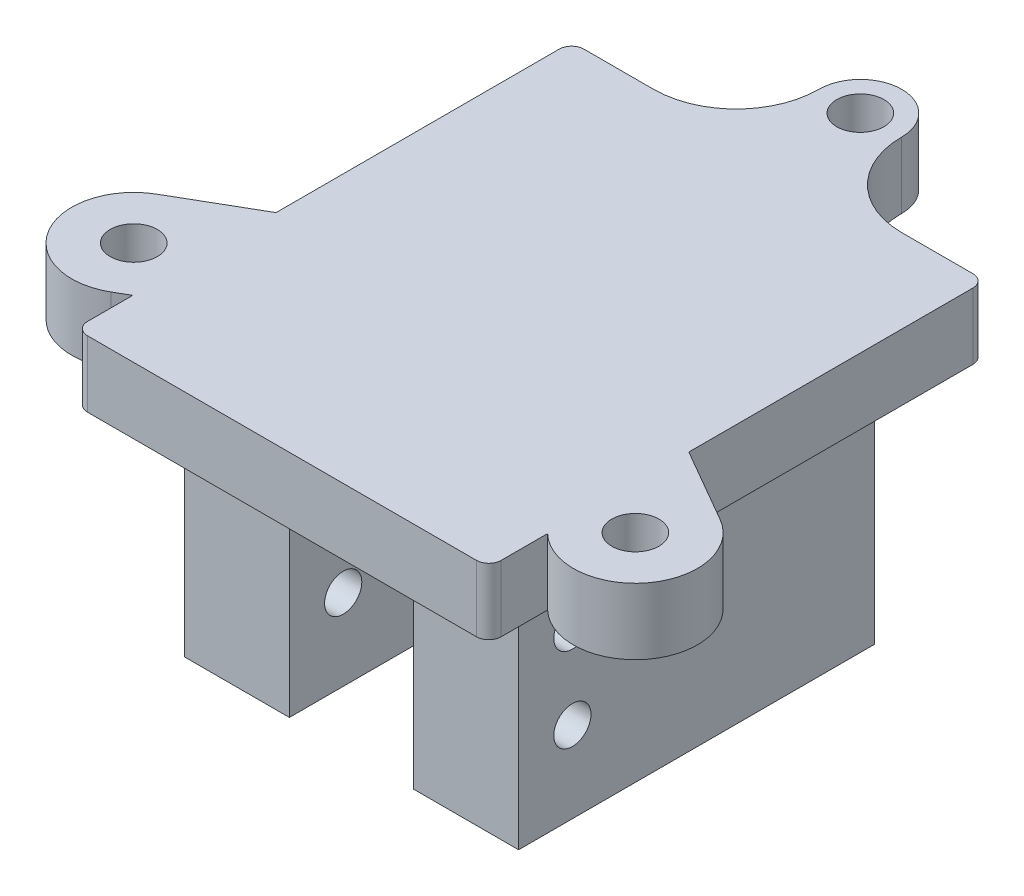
ISO-10303-21;
HEADER;
FILE_DESCRIPTION(('STEP AP214'),'2;1');
FILE_NAME('part.step','',(''),(''),'','','');
FILE_SCHEMA(('AUTOMOTIVE_DESIGN { 1 0 10303 214 1 1 1 1 }'));
ENDSEC;
DATA;
#1=APPLICATION_CONTEXT('core data for automotive mechanical design processes');
#2=APPLICATION_PROTOCOL_DEFINITION('international standard','automotive_design',2000,#1);
#3=PRODUCT_CONTEXT('',#1,'mechanical');
#4=PRODUCT('Part','Part','',(#3));
#5=PRODUCT_RELATED_PRODUCT_CATEGORY('part','',(#4));
#6=PRODUCT_DEFINITION_FORMATION('','',#4);
#7=PRODUCT_DEFINITION_CONTEXT('part definition',#1,'design');
#8=PRODUCT_DEFINITION('design','',#6,#7);
#9=PRODUCT_DEFINITION_SHAPE('','',#8);
#10=(LENGTH_UNIT() NAMED_UNIT(*) SI_UNIT(.MILLI.,.METRE.));
#11=(NAMED_UNIT(*) PLANE_ANGLE_UNIT() SI_UNIT($,.RADIAN.));
#12=(NAMED_UNIT(*) SI_UNIT($,.STERADIAN.) SOLID_ANGLE_UNIT());
#13=UNCERTAINTY_MEASURE_WITH_UNIT(LENGTH_MEASURE(1.E-05),#10,'distance_accuracy_value','');
#14=(GEOMETRIC_REPRESENTATION_CONTEXT(3) GLOBAL_UNCERTAINTY_ASSIGNED_CONTEXT((#13)) GLOBAL_UNIT_ASSIGNED_CONTEXT((#10,
#11,#12)) REPRESENTATION_CONTEXT('',''));
#15=CARTESIAN_POINT('',(0.,0.,0.));
#16=DIRECTION('',(0.,0.,1.));
#17=DIRECTION('',(1.,0.,0.));
#18=AXIS2_PLACEMENT_3D('',#15,#16,#17);
#19=CARTESIAN_POINT('',(0.,0.,-30.));
#20=DIRECTION('',(0.,0.,1.));
#21=DIRECTION('',(1.,0.,0.));
#22=AXIS2_PLACEMENT_3D('',#19,#20,#21);
#23=PLANE('',#22);
#24=DIRECTION('',(-1.,0.,0.));
#25=VECTOR('',#24,1.);
#26=CARTESIAN_POINT('',(0.,4.,-30.));
#27=LINE('',#26,#25);
#28=CARTESIAN_POINT('',(-15.,4.,-30.));
#29=VERTEX_POINT('',#28);
#30=CARTESIAN_POINT('',(-23.3977333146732,4.,-30.));
#31=VERTEX_POINT('',#30);
#32=EDGE_CURVE('E506',#29,#31,#27,.T.);
#33=ORIENTED_EDGE('',*,*,#32,.F.);
#34=DIRECTION('',(0.,1.,0.));
#35=VECTOR('',#34,1.);
#36=CARTESIAN_POINT('',(-15.,0.,-30.));
#37=LINE('',#36,#35);
#38=CARTESIAN_POINT('',(-15.,-4.,-30.));
#39=VERTEX_POINT('',#38);
#40=EDGE_CURVE('E335',#29,#39,#37,.F.);
#41=ORIENTED_EDGE('',*,*,#40,.T.);
#42=DIRECTION('',(1.,0.,0.));
#43=VECTOR('',#42,1.);
#44=CARTESIAN_POINT('',(0.,-4.,-30.));
#45=LINE('',#44,#43);
#46=CARTESIAN_POINT('',(-23.3977333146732,-4.,-30.));
#47=VERTEX_POINT('',#46);
#48=EDGE_CURVE('E411',#47,#39,#45,.T.);
#49=ORIENTED_EDGE('',*,*,#48,.F.);
#50=DIRECTION('',(0.,-1.,0.));
#51=VECTOR('',#50,1.);
#52=CARTESIAN_POINT('',(-23.3977333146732,16.4399999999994,-30.));
#53=LINE('',#52,#51);
#54=EDGE_CURVE('E347',#47,#31,#53,.F.);
#55=ORIENTED_EDGE('',*,*,#54,.T.);
#56=EDGE_LOOP('',(#33,#41,#49,#55));
#57=FACE_BOUND('',#56,.T.);
#58=ADVANCED_FACE('F45',(#57),#23,.F.);
#59=CARTESIAN_POINT('',(0.,0.,30.));
#60=DIRECTION('',(0.,0.,1.));
#61=DIRECTION('',(1.,0.,0.));
#62=AXIS2_PLACEMENT_3D('',#59,#60,#61);
#63=PLANE('',#62);
#64=DIRECTION('',(-1.,0.,0.));
#65=VECTOR('',#64,1.);
#66=CARTESIAN_POINT('',(-18.3977333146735,3.99999999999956,30.));
#67=LINE('',#66,#65);
#68=CARTESIAN_POINT('',(23.6022666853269,4.,30.));
#69=VERTEX_POINT('',#68);
#70=CARTESIAN_POINT('',(-23.3977333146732,4.,30.));
#71=VERTEX_POINT('',#70);
#72=EDGE_CURVE('E325',#69,#71,#67,.T.);
#73=ORIENTED_EDGE('',*,*,#72,.T.);
#74=DIRECTION('',(0.,-1.,0.));
#75=VECTOR('',#74,1.);
#76=CARTESIAN_POINT('',(-23.3977333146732,0.,30.));
#77=LINE('',#76,#75);
#78=CARTESIAN_POINT('',(-23.3977333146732,-4.,30.));
#79=VERTEX_POINT('',#78);
#80=EDGE_CURVE('E350',#71,#79,#77,.T.);
#81=ORIENTED_EDGE('',*,*,#80,.T.);
#82=DIRECTION('',(1.,0.,0.));
#83=VECTOR('',#82,1.);
#84=CARTESIAN_POINT('',(0.,-4.,30.));
#85=LINE('',#84,#83);
#86=CARTESIAN_POINT('',(23.6022666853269,-4.,30.));
#87=VERTEX_POINT('',#86);
#88=EDGE_CURVE('E450',#79,#87,#85,.T.);
#89=ORIENTED_EDGE('',*,*,#88,.T.);
#90=DIRECTION('',(0.,1.,0.));
#91=VECTOR('',#90,1.);
#92=CARTESIAN_POINT('',(23.6022666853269,0.,30.));
#93=LINE('',#92,#91);
#94=EDGE_CURVE('E352',#87,#69,#93,.T.);
#95=ORIENTED_EDGE('',*,*,#94,.T.);
#96=EDGE_LOOP('',(#73,#81,#89,#95));
#97=FACE_BOUND('',#96,.T.);
#98=ADVANCED_FACE('F690',(#97),#63,.T.);
#99=CARTESIAN_POINT('',(-24.8977333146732,16.4399999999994,-30.));
#100=DIRECTION('',(-1.,0.,0.));
#101=DIRECTION('',(0.,0.,1.));
#102=AXIS2_PLACEMENT_3D('',#99,#100,#101);
#103=PLANE('',#102);
#104=DIRECTION('',(0.,-1.,0.));
#105=VECTOR('',#104,1.);
#106=CARTESIAN_POINT('',(-24.8977333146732,16.4399999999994,28.5));
#107=LINE('',#106,#105);
#108=CARTESIAN_POINT('',(-24.8977333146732,-4.,28.5));
#109=VERTEX_POINT('',#108);
#110=CARTESIAN_POINT('',(-24.8977333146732,4.,28.5));
#111=VERTEX_POINT('',#110);
#112=EDGE_CURVE('E342',#109,#111,#107,.F.);
#113=ORIENTED_EDGE('',*,*,#112,.T.);
#114=DIRECTION('',(0.,0.,-1.));
#115=VECTOR('',#114,1.);
#116=CARTESIAN_POINT('',(-24.8977333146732,4.,-30.));
#117=LINE('',#116,#115);
#118=CARTESIAN_POINT('',(-24.8977333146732,4.,23.0349670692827));
#119=VERTEX_POINT('',#118);
#120=EDGE_CURVE('E499',#111,#119,#117,.T.);
#121=ORIENTED_EDGE('',*,*,#120,.T.);
#122=DIRECTION('',(0.,1.,0.));
#123=VECTOR('',#122,1.);
#124=CARTESIAN_POINT('',(-24.8977333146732,-32.2095171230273,23.0349670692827));
#125=LINE('',#124,#123);
#126=CARTESIAN_POINT('',(-24.8977333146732,-4.,23.0349670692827));
#127=VERTEX_POINT('',#126);
#128=EDGE_CURVE('E297',#127,#119,#125,.T.);
#129=ORIENTED_EDGE('',*,*,#128,.F.);
#130=DIRECTION('',(0.,0.,1.));
#131=VECTOR('',#130,1.);
#132=CARTESIAN_POINT('',(-24.8977333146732,-4.,-30.));
#133=LINE('',#132,#131);
#134=EDGE_CURVE('E421',#127,#109,#133,.T.);
#135=ORIENTED_EDGE('',*,*,#134,.T.);
#136=EDGE_LOOP('',(#113,#121,#129,#135));
#137=FACE_BOUND('',#136,.T.);
#138=ADVANCED_FACE('F696',(#137),#103,.T.);
#139=DIRECTION('',(0.,1.,0.));
#140=VECTOR('',#139,1.);
#141=CARTESIAN_POINT('',(-24.8977333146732,-32.2095171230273,5.71445899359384));
#142=LINE('',#141,#140);
#143=CARTESIAN_POINT('',(-24.8977333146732,-4.,5.71445899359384));
#144=VERTEX_POINT('',#143);
#145=CARTESIAN_POINT('',(-24.8977333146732,4.,5.71445899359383));
#146=VERTEX_POINT('',#145);
#147=EDGE_CURVE('E304',#144,#146,#142,.T.);
#148=ORIENTED_EDGE('',*,*,#147,.T.);
#149=CARTESIAN_POINT('',(-24.8977333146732,4.,-28.5));
#150=VERTEX_POINT('',#149);
#151=EDGE_CURVE('E298',#146,#150,#117,.T.);
#152=ORIENTED_EDGE('',*,*,#151,.T.);
#153=DIRECTION('',(0.,-1.,0.));
#154=VECTOR('',#153,1.);
#155=CARTESIAN_POINT('',(-24.8977333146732,-9.,-28.5));
#156=LINE('',#155,#154);
#157=CARTESIAN_POINT('',(-24.8977333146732,-4.,-28.5));
#158=VERTEX_POINT('',#157);
#159=EDGE_CURVE('E345',#150,#158,#156,.T.);
#160=ORIENTED_EDGE('',*,*,#159,.T.);
#161=EDGE_CURVE('E417',#158,#144,#133,.T.);
#162=ORIENTED_EDGE('',*,*,#161,.T.);
#163=EDGE_LOOP('',(#148,#152,#160,#162));
#164=FACE_BOUND('',#163,.T.);
#165=ADVANCED_FACE('F491',(#164),#103,.T.);
#166=CARTESIAN_POINT('',(25.1022666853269,16.4399999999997,-30.));
#167=DIRECTION('',(1.,0.,0.));
#168=DIRECTION('',(0.,1.,0.));
#169=AXIS2_PLACEMENT_3D('',#166,#167,#168);
#170=PLANE('',#169);
#171=DIRECTION('',(0.,1.,0.));
#172=VECTOR('',#171,1.);
#173=CARTESIAN_POINT('',(25.1022666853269,16.4399999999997,-28.5));
#174=LINE('',#173,#172);
#175=CARTESIAN_POINT('',(25.1022666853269,-4.,-28.5));
#176=VERTEX_POINT('',#175);
#177=CARTESIAN_POINT('',(25.1022666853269,4.,-28.5));
#178=VERTEX_POINT('',#177);
#179=EDGE_CURVE('E355',#176,#178,#174,.T.);
#180=ORIENTED_EDGE('',*,*,#179,.T.);
#181=DIRECTION('',(0.,0.,1.));
#182=VECTOR('',#181,1.);
#183=CARTESIAN_POINT('',(25.1022666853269,4.,-30.));
#184=LINE('',#183,#182);
#185=CARTESIAN_POINT('',(25.1022666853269,4.,5.83254639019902));
#186=VERTEX_POINT('',#185);
#187=EDGE_CURVE('E387',#178,#186,#184,.T.);
#188=ORIENTED_EDGE('',*,*,#187,.T.);
#189=DIRECTION('',(0.,1.,0.));
#190=VECTOR('',#189,1.);
#191=CARTESIAN_POINT('',(25.1022666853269,-32.2095171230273,5.83254639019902));
#192=LINE('',#191,#190);
#193=CARTESIAN_POINT('',(25.1022666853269,-4.,5.83254639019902));
#194=VERTEX_POINT('',#193);
#195=EDGE_CURVE('E322',#194,#186,#192,.T.);
#196=ORIENTED_EDGE('',*,*,#195,.F.);
#197=DIRECTION('',(0.,0.,-1.));
#198=VECTOR('',#197,1.);
#199=CARTESIAN_POINT('',(25.1022666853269,-4.,-30.));
#200=LINE('',#199,#198);
#201=EDGE_CURVE('E378',#194,#176,#200,.T.);
#202=ORIENTED_EDGE('',*,*,#201,.T.);
#203=EDGE_LOOP('',(#180,#188,#196,#202));
#204=FACE_BOUND('',#203,.T.);
#205=ADVANCED_FACE('F385',(#204),#170,.T.);
#206=DIRECTION('',(0.,1.,0.));
#207=VECTOR('',#206,1.);
#208=CARTESIAN_POINT('',(25.1022666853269,-32.2095171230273,22.8963183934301));
#209=LINE('',#208,#207);
#210=CARTESIAN_POINT('',(25.1022666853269,-4.,22.8963183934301));
#211=VERTEX_POINT('',#210);
#212=CARTESIAN_POINT('',(25.1022666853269,4.,22.8963183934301));
#213=VERTEX_POINT('',#212);
#214=EDGE_CURVE('E321',#211,#213,#209,.T.);
#215=ORIENTED_EDGE('',*,*,#214,.T.);
#216=CARTESIAN_POINT('',(25.1022666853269,4.,28.5));
#217=VERTEX_POINT('',#216);
#218=EDGE_CURVE('E512',#213,#217,#184,.T.);
#219=ORIENTED_EDGE('',*,*,#218,.T.);
#220=DIRECTION('',(0.,1.,0.));
#221=VECTOR('',#220,1.);
#222=CARTESIAN_POINT('',(25.1022666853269,16.4399999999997,28.5));
#223=LINE('',#222,#221);
#224=CARTESIAN_POINT('',(25.1022666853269,-4.,28.5));
#225=VERTEX_POINT('',#224);
#226=EDGE_CURVE('E358',#217,#225,#223,.F.);
#227=ORIENTED_EDGE('',*,*,#226,.T.);
#228=EDGE_CURVE('E390',#225,#211,#200,.T.);
#229=ORIENTED_EDGE('',*,*,#228,.T.);
#230=EDGE_LOOP('',(#215,#219,#227,#229));
#231=FACE_BOUND('',#230,.T.);
#232=ADVANCED_FACE('F703',(#231),#170,.T.);
#233=DIRECTION('',(-1.,0.,0.));
#234=VECTOR('',#233,1.);
#235=CARTESIAN_POINT('',(0.,4.,-30.));
#236=LINE('',#235,#234);
#237=CARTESIAN_POINT('',(23.6022666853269,4.,-30.));
#238=VERTEX_POINT('',#237);
#239=CARTESIAN_POINT('',(15.,4.,-30.));
#240=VERTEX_POINT('',#239);
#241=EDGE_CURVE('E368',#238,#240,#236,.T.);
#242=ORIENTED_EDGE('',*,*,#241,.F.);
#243=DIRECTION('',(0.,1.,0.));
#244=VECTOR('',#243,1.);
#245=CARTESIAN_POINT('',(23.6022666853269,-9.,-30.));
#246=LINE('',#245,#244);
#247=CARTESIAN_POINT('',(23.6022666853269,-4.,-30.));
#248=VERTEX_POINT('',#247);
#249=EDGE_CURVE('E53',#238,#248,#246,.F.);
#250=ORIENTED_EDGE('',*,*,#249,.T.);
#251=DIRECTION('',(1.,0.,0.));
#252=VECTOR('',#251,1.);
#253=CARTESIAN_POINT('',(0.,-4.,-30.));
#254=LINE('',#253,#252);
#255=CARTESIAN_POINT('',(15.,-4.,-30.));
#256=VERTEX_POINT('',#255);
#257=EDGE_CURVE('E365',#256,#248,#254,.T.);
#258=ORIENTED_EDGE('',*,*,#257,.F.);
#259=DIRECTION('',(0.,1.,0.));
#260=VECTOR('',#259,1.);
#261=CARTESIAN_POINT('',(15.,3.99999999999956,-30.));
#262=LINE('',#261,#260);
#263=EDGE_CURVE('E332',#256,#240,#262,.T.);
#264=ORIENTED_EDGE('',*,*,#263,.T.);
#265=EDGE_LOOP('',(#242,#250,#258,#264));
#266=FACE_BOUND('',#265,.T.);
#267=ADVANCED_FACE('F364',(#266),#23,.F.);
#268=CARTESIAN_POINT('',(30.3108891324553,-32.2095171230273,17.5000000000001));
#269=DIRECTION('',(0.,1.,0.));
#270=DIRECTION('',(0.,0.,1.));
#271=AXIS2_PLACEMENT_3D('',#268,#269,#270);
#272=CYLINDRICAL_SURFACE('',#271,7.5);
#273=DIRECTION('',(0.,1.,0.));
#274=VECTOR('',#273,1.);
#275=CARTESIAN_POINT('',(34.0608891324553,-32.2095171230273,11.0048094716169));
#276=LINE('',#275,#274);
#277=CARTESIAN_POINT('',(34.0608891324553,-4.,11.0048094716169));
#278=VERTEX_POINT('',#277);
#279=CARTESIAN_POINT('',(34.0608891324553,4.,11.0048094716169));
#280=VERTEX_POINT('',#279);
#281=EDGE_CURVE('E326',#278,#280,#276,.T.);
#282=ORIENTED_EDGE('',*,*,#281,.T.);
#283=CARTESIAN_POINT('',(30.3108891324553,4.,17.5000000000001));
#284=DIRECTION('',(0.,1.,0.));
#285=DIRECTION('',(0.,0.,1.));
#286=AXIS2_PLACEMENT_3D('',#283,#284,#285);
#287=CIRCLE('',#286,7.5);
#288=EDGE_CURVE('E318',#213,#280,#287,.T.);
#289=ORIENTED_EDGE('',*,*,#288,.F.);
#290=ORIENTED_EDGE('',*,*,#214,.F.);
#291=CARTESIAN_POINT('',(30.3108891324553,-4.,17.5000000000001));
#292=DIRECTION('',(0.,-1.,0.));
#293=DIRECTION('',(0.,0.,-1.));
#294=AXIS2_PLACEMENT_3D('',#291,#292,#293);
#295=CIRCLE('',#294,7.5);
#296=EDGE_CURVE('E395',#211,#278,#295,.F.);
#297=ORIENTED_EDGE('',*,*,#296,.T.);
#298=EDGE_LOOP('',(#282,#289,#290,#297));
#299=FACE_BOUND('',#298,.T.);
#300=ADVANCED_FACE('F702',(#299),#272,.T.);
#301=CARTESIAN_POINT('',(3.75000000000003,-32.2095171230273,-6.49519052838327));
#302=DIRECTION('',(-0.500000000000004,0.,0.866025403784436));
#303=DIRECTION('',(0.866025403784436,0.,0.500000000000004));
#304=AXIS2_PLACEMENT_3D('',#301,#302,#303);
#305=PLANE('',#304);
#306=DIRECTION('',(-0.866025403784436,0.,-0.500000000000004));
#307=VECTOR('',#306,1.);
#308=CARTESIAN_POINT('',(3.75000000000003,4.,-6.49519052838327));
#309=LINE('',#308,#307);
#310=EDGE_CURVE('E511',#280,#186,#309,.T.);
#311=ORIENTED_EDGE('',*,*,#310,.F.);
#312=ORIENTED_EDGE('',*,*,#281,.F.);
#313=DIRECTION('',(0.866025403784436,0.,0.500000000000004));
#314=VECTOR('',#313,1.);
#315=CARTESIAN_POINT('',(3.75000000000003,-4.,-6.49519052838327));
#316=LINE('',#315,#314);
#317=EDGE_CURVE('E403',#194,#278,#316,.T.);
#318=ORIENTED_EDGE('',*,*,#317,.F.);
#319=ORIENTED_EDGE('',*,*,#195,.T.);
#320=EDGE_LOOP('',(#311,#312,#318,#319));
#321=FACE_BOUND('',#320,.T.);
#322=ADVANCED_FACE('F708',(#321),#305,.F.);
#323=CARTESIAN_POINT('',(30.3108891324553,-32.2095171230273,17.5000000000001));
#324=DIRECTION('',(0.,1.,0.));
#325=DIRECTION('',(0.,0.,1.));
#326=AXIS2_PLACEMENT_3D('',#323,#324,#325);
#327=CYLINDRICAL_SURFACE('',#326,2.84999999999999);
#328=CARTESIAN_POINT('',(30.3108891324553,-4.,17.5000000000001));
#329=DIRECTION('',(0.,-1.,0.));
#330=DIRECTION('',(0.,0.,-1.));
#331=AXIS2_PLACEMENT_3D('',#328,#329,#330);
#332=CIRCLE('',#331,2.84999999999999);
#333=CARTESIAN_POINT('',(30.3108891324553,-4.,14.6500000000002));
#334=VERTEX_POINT('',#333);
#335=EDGE_CURVE('E458',#334,#334,#332,.F.);
#336=ORIENTED_EDGE('',*,*,#335,.F.);
#337=EDGE_LOOP('',(#336));
#338=FACE_BOUND('',#337,.T.);
#339=CARTESIAN_POINT('',(30.3108891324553,4.,17.5000000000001));
#340=DIRECTION('',(0.,1.,0.));
#341=DIRECTION('',(0.,0.,1.));
#342=AXIS2_PLACEMENT_3D('',#339,#340,#341);
#343=CIRCLE('',#342,2.84999999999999);
#344=CARTESIAN_POINT('',(30.3108891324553,4.,20.3500000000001));
#345=VERTEX_POINT('',#344);
#346=EDGE_CURVE('E520',#345,#345,#343,.F.);
#347=ORIENTED_EDGE('',*,*,#346,.F.);
#348=EDGE_LOOP('',(#347));
#349=FACE_BOUND('',#348,.T.);
#350=ADVANCED_FACE('F760',(#338,#349),#327,.F.);
#351=CARTESIAN_POINT('',(-30.3108891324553,-32.2095171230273,17.5000000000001));
#352=DIRECTION('',(0.,1.,0.));
#353=DIRECTION('',(0.,0.,1.));
#354=AXIS2_PLACEMENT_3D('',#351,#352,#353);
#355=CYLINDRICAL_SURFACE('',#354,7.5);
#356=CARTESIAN_POINT('',(-30.3108891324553,4.,17.5000000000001));
#357=DIRECTION('',(0.,1.,0.));
#358=DIRECTION('',(0.,0.,1.));
#359=AXIS2_PLACEMENT_3D('',#356,#357,#358);
#360=CIRCLE('',#359,7.5);
#361=CARTESIAN_POINT('',(-34.0608891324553,4.,11.0048094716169));
#362=VERTEX_POINT('',#361);
#363=CARTESIAN_POINT('',(-26.5608891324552,4.,23.9951905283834));
#364=VERTEX_POINT('',#363);
#365=EDGE_CURVE('E274',#362,#364,#360,.T.);
#366=ORIENTED_EDGE('',*,*,#365,.F.);
#367=DIRECTION('',(0.,1.,0.));
#368=VECTOR('',#367,1.);
#369=CARTESIAN_POINT('',(-34.0608891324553,-32.2095171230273,11.0048094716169));
#370=LINE('',#369,#368);
#371=CARTESIAN_POINT('',(-34.0608891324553,-4.,11.0048094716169));
#372=VERTEX_POINT('',#371);
#373=EDGE_CURVE('E287',#372,#362,#370,.T.);
#374=ORIENTED_EDGE('',*,*,#373,.F.);
#375=CARTESIAN_POINT('',(-30.3108891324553,-4.,17.5000000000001));
#376=DIRECTION('',(0.,-1.,0.));
#377=DIRECTION('',(0.,0.,-1.));
#378=AXIS2_PLACEMENT_3D('',#375,#376,#377);
#379=CIRCLE('',#378,7.5);
#380=CARTESIAN_POINT('',(-26.5608891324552,-4.,23.9951905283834));
#381=VERTEX_POINT('',#380);
#382=EDGE_CURVE('E302',#372,#381,#379,.F.);
#383=ORIENTED_EDGE('',*,*,#382,.T.);
#384=DIRECTION('',(0.,1.,0.));
#385=VECTOR('',#384,1.);
#386=CARTESIAN_POINT('',(-26.5608891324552,-32.2095171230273,23.9951905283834));
#387=LINE('',#386,#385);
#388=EDGE_CURVE('E295',#381,#364,#387,.T.);
#389=ORIENTED_EDGE('',*,*,#388,.T.);
#390=EDGE_LOOP('',(#366,#374,#383,#389));
#391=FACE_BOUND('',#390,.T.);
#392=ADVANCED_FACE('F301',(#391),#355,.T.);
#393=CARTESIAN_POINT('',(3.75000000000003,-32.2095171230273,6.49519052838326));
#394=DIRECTION('',(-0.500000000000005,0.,-0.866025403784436));
#395=DIRECTION('',(-0.866025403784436,0.,0.500000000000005));
#396=AXIS2_PLACEMENT_3D('',#393,#394,#395);
#397=PLANE('',#396);
#398=DIRECTION('',(0.866025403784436,0.,-0.500000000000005));
#399=VECTOR('',#398,1.);
#400=CARTESIAN_POINT('',(3.75000000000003,4.,6.49519052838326));
#401=LINE('',#400,#399);
#402=EDGE_CURVE('E279',#364,#119,#401,.T.);
#403=ORIENTED_EDGE('',*,*,#402,.F.);
#404=ORIENTED_EDGE('',*,*,#388,.F.);
#405=DIRECTION('',(-0.866025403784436,0.,0.500000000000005));
#406=VECTOR('',#405,1.);
#407=CARTESIAN_POINT('',(3.75000000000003,-4.,6.49519052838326));
#408=LINE('',#407,#406);
#409=EDGE_CURVE('E436',#127,#381,#408,.T.);
#410=ORIENTED_EDGE('',*,*,#409,.F.);
#411=ORIENTED_EDGE('',*,*,#128,.T.);
#412=EDGE_LOOP('',(#403,#404,#410,#411));
#413=FACE_BOUND('',#412,.T.);
#414=ADVANCED_FACE('F293',(#413),#397,.F.);
#415=CARTESIAN_POINT('',(-3.75000000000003,-32.2095171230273,-6.49519052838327));
#416=DIRECTION('',(-0.500000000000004,0.,-0.866025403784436));
#417=DIRECTION('',(-0.866025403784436,0.,0.500000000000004));
#418=AXIS2_PLACEMENT_3D('',#415,#416,#417);
#419=PLANE('',#418);
#420=ORIENTED_EDGE('',*,*,#373,.T.);
#421=DIRECTION('',(0.866025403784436,0.,-0.500000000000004));
#422=VECTOR('',#421,1.);
#423=CARTESIAN_POINT('',(-3.75000000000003,4.,-6.49519052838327));
#424=LINE('',#423,#422);
#425=EDGE_CURVE('E282',#362,#146,#424,.T.);
#426=ORIENTED_EDGE('',*,*,#425,.T.);
#427=ORIENTED_EDGE('',*,*,#147,.F.);
#428=DIRECTION('',(-0.866025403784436,0.,0.500000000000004));
#429=VECTOR('',#428,1.);
#430=CARTESIAN_POINT('',(-3.75000000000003,-4.,-6.49519052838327));
#431=LINE('',#430,#429);
#432=EDGE_CURVE('E428',#144,#372,#431,.T.);
#433=ORIENTED_EDGE('',*,*,#432,.T.);
#434=EDGE_LOOP('',(#420,#426,#427,#433));
#435=FACE_BOUND('',#434,.T.);
#436=ADVANCED_FACE('F495',(#435),#419,.T.);
#437=CARTESIAN_POINT('',(-30.3108891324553,-32.2095171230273,17.5000000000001));
#438=DIRECTION('',(0.,1.,0.));
#439=DIRECTION('',(0.,0.,1.));
#440=AXIS2_PLACEMENT_3D('',#437,#438,#439);
#441=CYLINDRICAL_SURFACE('',#440,2.85);
#442=CARTESIAN_POINT('',(-30.3108891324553,-4.,17.5000000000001));
#443=DIRECTION('',(0.,-1.,0.));
#444=DIRECTION('',(0.,0.,-1.));
#445=AXIS2_PLACEMENT_3D('',#442,#443,#444);
#446=CIRCLE('',#445,2.85);
#447=CARTESIAN_POINT('',(-30.3108891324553,-4.,14.6500000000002));
#448=VERTEX_POINT('',#447);
#449=EDGE_CURVE('E452',#448,#448,#446,.F.);
#450=ORIENTED_EDGE('',*,*,#449,.F.);
#451=EDGE_LOOP('',(#450));
#452=FACE_BOUND('',#451,.T.);
#453=CARTESIAN_POINT('',(-30.3108891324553,4.,17.5000000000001));
#454=DIRECTION('',(0.,1.,0.));
#455=DIRECTION('',(0.,0.,1.));
#456=AXIS2_PLACEMENT_3D('',#453,#454,#455);
#457=CIRCLE('',#456,2.85);
#458=CARTESIAN_POINT('',(-30.3108891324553,4.,20.3500000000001));
#459=VERTEX_POINT('',#458);
#460=EDGE_CURVE('E517',#459,#459,#457,.F.);
#461=ORIENTED_EDGE('',*,*,#460,.F.);
#462=EDGE_LOOP('',(#461));
#463=FACE_BOUND('',#462,.T.);
#464=ADVANCED_FACE('F722',(#452,#463),#441,.F.);
#465=CARTESIAN_POINT('',(15.,0.,-40.));
#466=DIRECTION('',(0.,-1.,0.));
#467=DIRECTION('',(0.,0.,-1.));
#468=AXIS2_PLACEMENT_3D('',#465,#466,#467);
#469=CYLINDRICAL_SURFACE('',#468,10.);
#470=CARTESIAN_POINT('',(15.,3.99999999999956,-40.));
#471=DIRECTION('',(0.,1.,0.));
#472=DIRECTION('',(0.,0.,1.));
#473=AXIS2_PLACEMENT_3D('',#470,#471,#472);
#474=CIRCLE('',#473,10.);
#475=CARTESIAN_POINT('',(5.00000000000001,4.,-40.));
#476=VERTEX_POINT('',#475);
#477=EDGE_CURVE('E337',#240,#476,#474,.F.);
#478=ORIENTED_EDGE('',*,*,#477,.F.);
#479=ORIENTED_EDGE('',*,*,#263,.F.);
#480=CARTESIAN_POINT('',(15.,-4.,-40.));
#481=DIRECTION('',(0.,-1.,0.));
#482=DIRECTION('',(0.,0.,-1.));
#483=AXIS2_PLACEMENT_3D('',#480,#481,#482);
#484=CIRCLE('',#483,10.);
#485=CARTESIAN_POINT('',(5.00000000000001,-4.,-40.));
#486=VERTEX_POINT('',#485);
#487=EDGE_CURVE('E377',#486,#256,#484,.F.);
#488=ORIENTED_EDGE('',*,*,#487,.F.);
#489=DIRECTION('',(0.,1.,0.));
#490=VECTOR('',#489,1.);
#491=CARTESIAN_POINT('',(5.00000000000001,-32.2095171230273,-40.));
#492=LINE('',#491,#490);
#493=EDGE_CURVE('E316',#486,#476,#492,.T.);
#494=ORIENTED_EDGE('',*,*,#493,.T.);
#495=EDGE_LOOP('',(#478,#479,#488,#494));
#496=FACE_BOUND('',#495,.T.);
#497=ADVANCED_FACE('F718',(#496),#469,.F.);
#498=CARTESIAN_POINT('',(-15.,-32.2095171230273,-40.));
#499=DIRECTION('',(0.,1.,0.));
#500=DIRECTION('',(0.,0.,1.));
#501=AXIS2_PLACEMENT_3D('',#498,#499,#500);
#502=CYLINDRICAL_SURFACE('',#501,10.);
#503=ORIENTED_EDGE('',*,*,#40,.F.);
#504=CARTESIAN_POINT('',(-15.,3.99999999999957,-40.));
#505=DIRECTION('',(0.,1.,0.));
#506=DIRECTION('',(0.,0.,1.));
#507=AXIS2_PLACEMENT_3D('',#504,#505,#506);
#508=CIRCLE('',#507,10.);
#509=CARTESIAN_POINT('',(-5.00000000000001,4.,-40.));
#510=VERTEX_POINT('',#509);
#511=EDGE_CURVE('E340',#510,#29,#508,.F.);
#512=ORIENTED_EDGE('',*,*,#511,.F.);
#513=DIRECTION('',(0.,1.,0.));
#514=VECTOR('',#513,1.);
#515=CARTESIAN_POINT('',(-5.00000000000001,-32.2095171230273,-40.));
#516=LINE('',#515,#514);
#517=CARTESIAN_POINT('',(-5.00000000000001,-4.,-40.));
#518=VERTEX_POINT('',#517);
#519=EDGE_CURVE('E315',#518,#510,#516,.T.);
#520=ORIENTED_EDGE('',*,*,#519,.F.);
#521=CARTESIAN_POINT('',(-15.,-4.,-40.));
#522=DIRECTION('',(0.,-1.,0.));
#523=DIRECTION('',(0.,0.,-1.));
#524=AXIS2_PLACEMENT_3D('',#521,#522,#523);
#525=CIRCLE('',#524,10.);
#526=EDGE_CURVE('E400',#39,#518,#525,.F.);
#527=ORIENTED_EDGE('',*,*,#526,.F.);
#528=EDGE_LOOP('',(#503,#512,#520,#527));
#529=FACE_BOUND('',#528,.T.);
#530=ADVANCED_FACE('F721',(#529),#502,.F.);
#531=CARTESIAN_POINT('',(-23.3977333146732,16.4399999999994,-28.5));
#532=DIRECTION('',(0.,1.,0.));
#533=DIRECTION('',(0.,0.,1.));
#534=AXIS2_PLACEMENT_3D('',#531,#532,#533);
#535=CYLINDRICAL_SURFACE('',#534,1.5);
#536=ORIENTED_EDGE('',*,*,#159,.F.);
#537=CARTESIAN_POINT('',(-23.3977333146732,4.,-28.5));
#538=DIRECTION('',(0.,1.,0.));
#539=DIRECTION('',(0.,0.,1.));
#540=AXIS2_PLACEMENT_3D('',#537,#538,#539);
#541=CIRCLE('',#540,1.5);
#542=EDGE_CURVE('E503',#150,#31,#541,.F.);
#543=ORIENTED_EDGE('',*,*,#542,.T.);
#544=ORIENTED_EDGE('',*,*,#54,.F.);
#545=CARTESIAN_POINT('',(-23.3977333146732,-4.,-28.5));
#546=DIRECTION('',(0.,-1.,0.));
#547=DIRECTION('',(0.,0.,-1.));
#548=AXIS2_PLACEMENT_3D('',#545,#546,#547);
#549=CIRCLE('',#548,1.5);
#550=EDGE_CURVE('E414',#47,#158,#549,.F.);
#551=ORIENTED_EDGE('',*,*,#550,.T.);
#552=EDGE_LOOP('',(#536,#543,#544,#551));
#553=FACE_BOUND('',#552,.T.);
#554=ADVANCED_FACE('F726',(#553),#535,.T.);
#555=CARTESIAN_POINT('',(-23.3977333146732,0.,28.5));
#556=DIRECTION('',(0.,-1.,0.));
#557=DIRECTION('',(0.,0.,-1.));
#558=AXIS2_PLACEMENT_3D('',#555,#556,#557);
#559=CYLINDRICAL_SURFACE('',#558,1.5);
#560=ORIENTED_EDGE('',*,*,#80,.F.);
#561=CARTESIAN_POINT('',(-23.3977333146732,4.,28.5));
#562=DIRECTION('',(0.,1.,0.));
#563=DIRECTION('',(0.,0.,1.));
#564=AXIS2_PLACEMENT_3D('',#561,#562,#563);
#565=CIRCLE('',#564,1.5);
#566=EDGE_CURVE('E500',#71,#111,#565,.F.);
#567=ORIENTED_EDGE('',*,*,#566,.T.);
#568=ORIENTED_EDGE('',*,*,#112,.F.);
#569=CARTESIAN_POINT('',(-23.3977333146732,-4.,28.5));
#570=DIRECTION('',(0.,-1.,0.));
#571=DIRECTION('',(0.,0.,-1.));
#572=AXIS2_PLACEMENT_3D('',#569,#570,#571);
#573=CIRCLE('',#572,1.5);
#574=EDGE_CURVE('E441',#109,#79,#573,.F.);
#575=ORIENTED_EDGE('',*,*,#574,.T.);
#576=EDGE_LOOP('',(#560,#567,#568,#575));
#577=FACE_BOUND('',#576,.T.);
#578=ADVANCED_FACE('F730',(#577),#559,.T.);
#579=CARTESIAN_POINT('',(23.6022666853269,0.,28.5));
#580=DIRECTION('',(0.,1.,0.));
#581=DIRECTION('',(-1.,0.,0.));
#582=AXIS2_PLACEMENT_3D('',#579,#580,#581);
#583=CYLINDRICAL_SURFACE('',#582,1.5);
#584=ORIENTED_EDGE('',*,*,#226,.F.);
#585=CARTESIAN_POINT('',(23.6022666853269,4.,28.5));
#586=DIRECTION('',(0.,1.,0.));
#587=DIRECTION('',(0.,0.,1.));
#588=AXIS2_PLACEMENT_3D('',#585,#586,#587);
#589=CIRCLE('',#588,1.5);
#590=EDGE_CURVE('E514',#217,#69,#589,.F.);
#591=ORIENTED_EDGE('',*,*,#590,.T.);
#592=ORIENTED_EDGE('',*,*,#94,.F.);
#593=CARTESIAN_POINT('',(23.6022666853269,-4.,28.5));
#594=DIRECTION('',(0.,-1.,0.));
#595=DIRECTION('',(0.,0.,-1.));
#596=AXIS2_PLACEMENT_3D('',#593,#594,#595);
#597=CIRCLE('',#596,1.5);
#598=EDGE_CURVE('E394',#87,#225,#597,.F.);
#599=ORIENTED_EDGE('',*,*,#598,.T.);
#600=EDGE_LOOP('',(#584,#591,#592,#599));
#601=FACE_BOUND('',#600,.T.);
#602=ADVANCED_FACE('F733',(#601),#583,.T.);
#603=CARTESIAN_POINT('',(23.6022666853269,16.4399999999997,-28.5));
#604=DIRECTION('',(0.,-1.,0.));
#605=DIRECTION('',(1.,0.,0.));
#606=AXIS2_PLACEMENT_3D('',#603,#604,#605);
#607=CYLINDRICAL_SURFACE('',#606,1.5);
#608=ORIENTED_EDGE('',*,*,#249,.F.);
#609=CARTESIAN_POINT('',(23.6022666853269,4.,-28.5));
#610=DIRECTION('',(0.,1.,0.));
#611=DIRECTION('',(0.,0.,1.));
#612=AXIS2_PLACEMENT_3D('',#609,#610,#611);
#613=CIRCLE('',#612,1.5);
#614=EDGE_CURVE('E382',#238,#178,#613,.F.);
#615=ORIENTED_EDGE('',*,*,#614,.T.);
#616=ORIENTED_EDGE('',*,*,#179,.F.);
#617=CARTESIAN_POINT('',(23.6022666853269,-4.,-28.5));
#618=DIRECTION('',(0.,-1.,0.));
#619=DIRECTION('',(0.,0.,-1.));
#620=AXIS2_PLACEMENT_3D('',#617,#618,#619);
#621=CIRCLE('',#620,1.5);
#622=EDGE_CURVE('E11',#176,#248,#621,.F.);
#623=ORIENTED_EDGE('',*,*,#622,.T.);
#624=EDGE_LOOP('',(#608,#615,#616,#623));
#625=FACE_BOUND('',#624,.T.);
#626=ADVANCED_FACE('F47',(#625),#607,.T.);
#627=CARTESIAN_POINT('',(-21.5,-2.25,-21.5));
#628=DIRECTION('',(0.,0.,-1.));
#629=DIRECTION('',(-1.,0.,0.));
#630=AXIS2_PLACEMENT_3D('',#627,#628,#629);
#631=PLANE('',#630);
#632=DIRECTION('',(0.,-1.,0.));
#633=VECTOR('',#632,1.);
#634=CARTESIAN_POINT('',(20.2,-2.25,-21.5));
#635=LINE('',#634,#633);
#636=CARTESIAN_POINT('',(20.2,-2.25,-21.5));
#637=VERTEX_POINT('',#636);
#638=CARTESIAN_POINT('',(20.2,-4.,-21.5));
#639=VERTEX_POINT('',#638);
#640=EDGE_CURVE('E549',#637,#639,#635,.T.);
#641=ORIENTED_EDGE('',*,*,#640,.T.);
#642=DIRECTION('',(-1.,0.,0.));
#643=VECTOR('',#642,1.);
#644=CARTESIAN_POINT('',(-21.5,-4.,-21.5));
#645=LINE('',#644,#643);
#646=CARTESIAN_POINT('',(21.5,-4.,-21.5));
#647=VERTEX_POINT('',#646);
#648=EDGE_CURVE('E433',#647,#639,#645,.T.);
#649=ORIENTED_EDGE('',*,*,#648,.F.);
#650=DIRECTION('',(0.,-1.,0.));
#651=VECTOR('',#650,1.);
#652=CARTESIAN_POINT('',(21.5,-2.25,-21.5));
#653=LINE('',#652,#651);
#654=CARTESIAN_POINT('',(21.5,-2.25,-21.5));
#655=VERTEX_POINT('',#654);
#656=EDGE_CURVE('E288',#655,#647,#653,.T.);
#657=ORIENTED_EDGE('',*,*,#656,.F.);
#658=DIRECTION('',(1.,0.,0.));
#659=VECTOR('',#658,1.);
#660=CARTESIAN_POINT('',(-21.5,-2.25,-21.5));
#661=LINE('',#660,#659);
#662=EDGE_CURVE('E472',#637,#655,#661,.T.);
#663=ORIENTED_EDGE('',*,*,#662,.F.);
#664=EDGE_LOOP('',(#641,#649,#657,#663));
#665=FACE_BOUND('',#664,.T.);
#666=ADVANCED_FACE('F637',(#665),#631,.F.);
#667=CARTESIAN_POINT('',(-21.5,-2.25,21.5));
#668=DIRECTION('',(0.,0.,1.));
#669=DIRECTION('',(1.,0.,0.));
#670=AXIS2_PLACEMENT_3D('',#667,#668,#669);
#671=PLANE('',#670);
#672=DIRECTION('',(0.,1.,0.));
#673=VECTOR('',#672,1.);
#674=CARTESIAN_POINT('',(20.2,-2.25,21.5));
#675=LINE('',#674,#673);
#676=CARTESIAN_POINT('',(20.2,-4.,21.5));
#677=VERTEX_POINT('',#676);
#678=CARTESIAN_POINT('',(20.2,-2.25,21.5));
#679=VERTEX_POINT('',#678);
#680=EDGE_CURVE('E554',#677,#679,#675,.T.);
#681=ORIENTED_EDGE('',*,*,#680,.T.);
#682=DIRECTION('',(-1.,0.,0.));
#683=VECTOR('',#682,1.);
#684=CARTESIAN_POINT('',(-21.5,-2.25,21.5));
#685=LINE('',#684,#683);
#686=CARTESIAN_POINT('',(21.5,-2.25,21.5));
#687=VERTEX_POINT('',#686);
#688=EDGE_CURVE('E465',#687,#679,#685,.T.);
#689=ORIENTED_EDGE('',*,*,#688,.F.);
#690=DIRECTION('',(0.,-1.,0.));
#691=VECTOR('',#690,1.);
#692=CARTESIAN_POINT('',(21.5,-2.25,21.5));
#693=LINE('',#692,#691);
#694=CARTESIAN_POINT('',(21.5,-4.,21.5));
#695=VERTEX_POINT('',#694);
#696=EDGE_CURVE('E476',#687,#695,#693,.T.);
#697=ORIENTED_EDGE('',*,*,#696,.T.);
#698=DIRECTION('',(1.,0.,0.));
#699=VECTOR('',#698,1.);
#700=CARTESIAN_POINT('',(-21.5,-4.,21.5));
#701=LINE('',#700,#699);
#702=EDGE_CURVE('E420',#677,#695,#701,.T.);
#703=ORIENTED_EDGE('',*,*,#702,.F.);
#704=EDGE_LOOP('',(#681,#689,#697,#703));
#705=FACE_BOUND('',#704,.T.);
#706=ADVANCED_FACE('F688',(#705),#671,.F.);
#707=CARTESIAN_POINT('',(0.,-2.25,0.));
#708=DIRECTION('',(0.,-1.,0.));
#709=DIRECTION('',(0.,0.,-1.));
#710=AXIS2_PLACEMENT_3D('',#707,#708,#709);
#711=PLANE('',#710);
#712=ORIENTED_EDGE('',*,*,#688,.T.);
#713=DIRECTION('',(0.,0.,-1.));
#714=VECTOR('',#713,1.);
#715=CARTESIAN_POINT('',(20.2,-2.25,-21.5));
#716=LINE('',#715,#714);
#717=EDGE_CURVE('E556',#679,#637,#716,.T.);
#718=ORIENTED_EDGE('',*,*,#717,.T.);
#719=ORIENTED_EDGE('',*,*,#662,.T.);
#720=DIRECTION('',(0.,0.,1.));
#721=VECTOR('',#720,1.);
#722=CARTESIAN_POINT('',(21.5,-2.25,21.5));
#723=LINE('',#722,#721);
#724=EDGE_CURVE('E461',#655,#687,#723,.T.);
#725=ORIENTED_EDGE('',*,*,#724,.T.);
#726=EDGE_LOOP('',(#712,#718,#719,#725));
#727=FACE_BOUND('',#726,.T.);
#728=ADVANCED_FACE('F676',(#727),#711,.T.);
#729=DIRECTION('',(0.,-1.,0.));
#730=VECTOR('',#729,1.);
#731=CARTESIAN_POINT('',(-20.2,-2.25,21.5));
#732=LINE('',#731,#730);
#733=CARTESIAN_POINT('',(-20.2,-2.25,21.5));
#734=VERTEX_POINT('',#733);
#735=CARTESIAN_POINT('',(-20.2,-4.,21.5));
#736=VERTEX_POINT('',#735);
#737=EDGE_CURVE('E589',#734,#736,#732,.T.);
#738=ORIENTED_EDGE('',*,*,#737,.T.);
#739=DIRECTION('',(1.,0.,0.));
#740=VECTOR('',#739,1.);
#741=CARTESIAN_POINT('',(-21.5,-4.,21.5));
#742=LINE('',#741,#740);
#743=CARTESIAN_POINT('',(-21.5,-4.,21.5));
#744=VERTEX_POINT('',#743);
#745=EDGE_CURVE('E447',#744,#736,#742,.T.);
#746=ORIENTED_EDGE('',*,*,#745,.F.);
#747=DIRECTION('',(0.,-1.,0.));
#748=VECTOR('',#747,1.);
#749=CARTESIAN_POINT('',(-21.5,-2.25,21.5));
#750=LINE('',#749,#748);
#751=CARTESIAN_POINT('',(-21.5,-2.25,21.5));
#752=VERTEX_POINT('',#751);
#753=EDGE_CURVE('E483',#752,#744,#750,.T.);
#754=ORIENTED_EDGE('',*,*,#753,.F.);
#755=EDGE_CURVE('E464',#734,#752,#685,.T.);
#756=ORIENTED_EDGE('',*,*,#755,.F.);
#757=EDGE_LOOP('',(#738,#746,#754,#756));
#758=FACE_BOUND('',#757,.T.);
#759=ADVANCED_FACE('F666',(#758),#671,.F.);
#760=DIRECTION('',(0.,1.,0.));
#761=VECTOR('',#760,1.);
#762=CARTESIAN_POINT('',(-20.2,-2.25,-21.5));
#763=LINE('',#762,#761);
#764=CARTESIAN_POINT('',(-20.2,-4.,-21.5));
#765=VERTEX_POINT('',#764);
#766=CARTESIAN_POINT('',(-20.2,-2.25,-21.5));
#767=VERTEX_POINT('',#766);
#768=EDGE_CURVE('E594',#765,#767,#763,.T.);
#769=ORIENTED_EDGE('',*,*,#768,.T.);
#770=CARTESIAN_POINT('',(-21.5,-2.25,-21.5));
#771=VERTEX_POINT('',#770);
#772=EDGE_CURVE('E473',#771,#767,#661,.T.);
#773=ORIENTED_EDGE('',*,*,#772,.F.);
#774=DIRECTION('',(0.,-1.,0.));
#775=VECTOR('',#774,1.);
#776=CARTESIAN_POINT('',(-21.5,-2.25,-21.5));
#777=LINE('',#776,#775);
#778=CARTESIAN_POINT('',(-21.5,-4.,-21.5));
#779=VERTEX_POINT('',#778);
#780=EDGE_CURVE('E480',#771,#779,#777,.T.);
#781=ORIENTED_EDGE('',*,*,#780,.T.);
#782=EDGE_CURVE('E432',#765,#779,#645,.T.);
#783=ORIENTED_EDGE('',*,*,#782,.F.);
#784=EDGE_LOOP('',(#769,#773,#781,#783));
#785=FACE_BOUND('',#784,.T.);
#786=ADVANCED_FACE('F620',(#785),#631,.F.);
#787=ORIENTED_EDGE('',*,*,#772,.T.);
#788=DIRECTION('',(0.,0.,1.));
#789=VECTOR('',#788,1.);
#790=CARTESIAN_POINT('',(-20.2,-2.25,21.5));
#791=LINE('',#790,#789);
#792=EDGE_CURVE('E596',#767,#734,#791,.T.);
#793=ORIENTED_EDGE('',*,*,#792,.T.);
#794=ORIENTED_EDGE('',*,*,#755,.T.);
#795=DIRECTION('',(0.,0.,-1.));
#796=VECTOR('',#795,1.);
#797=CARTESIAN_POINT('',(-21.5,-2.25,21.5));
#798=LINE('',#797,#796);
#799=EDGE_CURVE('E468',#752,#771,#798,.T.);
#800=ORIENTED_EDGE('',*,*,#799,.T.);
#801=EDGE_LOOP('',(#787,#793,#794,#800));
#802=FACE_BOUND('',#801,.T.);
#803=ADVANCED_FACE('F672',(#802),#711,.T.);
#804=CARTESIAN_POINT('',(0.,-32.2095171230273,-40.));
#805=DIRECTION('',(0.,1.,0.));
#806=DIRECTION('',(0.,0.,1.));
#807=AXIS2_PLACEMENT_3D('',#804,#805,#806);
#808=CYLINDRICAL_SURFACE('',#807,5.00000000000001);
#809=ORIENTED_EDGE('',*,*,#493,.F.);
#810=CARTESIAN_POINT('',(0.,-4.,-40.));
#811=DIRECTION('',(0.,-1.,0.));
#812=DIRECTION('',(0.,0.,-1.));
#813=AXIS2_PLACEMENT_3D('',#810,#811,#812);
#814=CIRCLE('',#813,5.00000000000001);
#815=EDGE_CURVE('E391',#486,#518,#814,.F.);
#816=ORIENTED_EDGE('',*,*,#815,.T.);
#817=ORIENTED_EDGE('',*,*,#519,.T.);
#818=CARTESIAN_POINT('',(0.,4.,-40.));
#819=DIRECTION('',(0.,1.,0.));
#820=DIRECTION('',(0.,0.,1.));
#821=AXIS2_PLACEMENT_3D('',#818,#819,#820);
#822=CIRCLE('',#821,5.00000000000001);
#823=EDGE_CURVE('E312',#476,#510,#822,.T.);
#824=ORIENTED_EDGE('',*,*,#823,.F.);
#825=EDGE_LOOP('',(#809,#816,#817,#824));
#826=FACE_BOUND('',#825,.T.);
#827=ADVANCED_FACE('F674',(#826),#808,.T.);
#828=CARTESIAN_POINT('',(0.,-32.2095171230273,-40.));
#829=DIRECTION('',(0.,1.,0.));
#830=DIRECTION('',(0.,0.,1.));
#831=AXIS2_PLACEMENT_3D('',#828,#829,#830);
#832=CYLINDRICAL_SURFACE('',#831,2.85);
#833=CARTESIAN_POINT('',(0.,4.,-40.));
#834=DIRECTION('',(0.,1.,0.));
#835=DIRECTION('',(0.,0.,1.));
#836=AXIS2_PLACEMENT_3D('',#833,#834,#835);
#837=CIRCLE('',#836,2.85);
#838=CARTESIAN_POINT('',(0.,4.,-37.15));
#839=VERTEX_POINT('',#838);
#840=EDGE_CURVE('E309',#839,#839,#837,.T.);
#841=ORIENTED_EDGE('',*,*,#840,.T.);
#842=EDGE_LOOP('',(#841));
#843=FACE_BOUND('',#842,.T.);
#844=CARTESIAN_POINT('',(0.,-4.,-40.));
#845=DIRECTION('',(0.,-1.,0.));
#846=DIRECTION('',(0.,0.,-1.));
#847=AXIS2_PLACEMENT_3D('',#844,#845,#846);
#848=CIRCLE('',#847,2.85);
#849=CARTESIAN_POINT('',(0.,-4.,-42.85));
#850=VERTEX_POINT('',#849);
#851=EDGE_CURVE('E455',#850,#850,#848,.F.);
#852=ORIENTED_EDGE('',*,*,#851,.F.);
#853=EDGE_LOOP('',(#852));
#854=FACE_BOUND('',#853,.T.);
#855=ADVANCED_FACE('F681',(#843,#854),#832,.F.);
#856=CARTESIAN_POINT('',(21.5,-2.25,21.5));
#857=DIRECTION('',(1.,0.,0.));
#858=DIRECTION('',(0.,0.,-1.));
#859=AXIS2_PLACEMENT_3D('',#856,#857,#858);
#860=PLANE('',#859);
#861=DIRECTION('',(0.,0.,-1.));
#862=VECTOR('',#861,1.);
#863=CARTESIAN_POINT('',(21.5,-4.,21.5));
#864=LINE('',#863,#862);
#865=EDGE_CURVE('E425',#695,#647,#864,.T.);
#866=ORIENTED_EDGE('',*,*,#865,.F.);
#867=ORIENTED_EDGE('',*,*,#696,.F.);
#868=ORIENTED_EDGE('',*,*,#724,.F.);
#869=ORIENTED_EDGE('',*,*,#656,.T.);
#870=EDGE_LOOP('',(#866,#867,#868,#869));
#871=FACE_BOUND('',#870,.T.);
#872=ADVANCED_FACE('F770',(#871),#860,.F.);
#873=CARTESIAN_POINT('',(7.5,-4.,-21.5));
#874=VERTEX_POINT('',#873);
#875=CARTESIAN_POINT('',(-7.49999999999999,-4.,-21.5));
#876=VERTEX_POINT('',#875);
#877=EDGE_CURVE('E438',#874,#876,#645,.T.);
#878=ORIENTED_EDGE('',*,*,#877,.F.);
#879=DIRECTION('',(0.,-1.,0.));
#880=VECTOR('',#879,1.);
#881=CARTESIAN_POINT('',(7.5,-2.25,-21.5));
#882=LINE('',#881,#880);
#883=CARTESIAN_POINT('',(7.5,-2.25,-21.5));
#884=VERTEX_POINT('',#883);
#885=EDGE_CURVE('E536',#884,#874,#882,.T.);
#886=ORIENTED_EDGE('',*,*,#885,.F.);
#887=CARTESIAN_POINT('',(-7.49999999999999,-2.25,-21.5));
#888=VERTEX_POINT('',#887);
#889=EDGE_CURVE('E477',#888,#884,#661,.T.);
#890=ORIENTED_EDGE('',*,*,#889,.F.);
#891=DIRECTION('',(0.,1.,0.));
#892=VECTOR('',#891,1.);
#893=CARTESIAN_POINT('',(-7.49999999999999,-2.25,-21.5));
#894=LINE('',#893,#892);
#895=EDGE_CURVE('E582',#876,#888,#894,.T.);
#896=ORIENTED_EDGE('',*,*,#895,.F.);
#897=EDGE_LOOP('',(#878,#886,#890,#896));
#898=FACE_BOUND('',#897,.T.);
#899=ADVANCED_FACE('F651',(#898),#631,.F.);
#900=CARTESIAN_POINT('',(-21.5,-2.25,21.5));
#901=DIRECTION('',(-1.,0.,0.));
#902=DIRECTION('',(0.,0.,1.));
#903=AXIS2_PLACEMENT_3D('',#900,#901,#902);
#904=PLANE('',#903);
#905=DIRECTION('',(0.,0.,1.));
#906=VECTOR('',#905,1.);
#907=CARTESIAN_POINT('',(-21.5,-4.,21.5));
#908=LINE('',#907,#906);
#909=EDGE_CURVE('E444',#779,#744,#908,.T.);
#910=ORIENTED_EDGE('',*,*,#909,.F.);
#911=ORIENTED_EDGE('',*,*,#780,.F.);
#912=ORIENTED_EDGE('',*,*,#799,.F.);
#913=ORIENTED_EDGE('',*,*,#753,.T.);
#914=EDGE_LOOP('',(#910,#911,#912,#913));
#915=FACE_BOUND('',#914,.T.);
#916=ADVANCED_FACE('F670',(#915),#904,.F.);
#917=CARTESIAN_POINT('',(7.5,-2.25,21.5));
#918=VERTEX_POINT('',#917);
#919=CARTESIAN_POINT('',(-7.5,-2.25,21.5));
#920=VERTEX_POINT('',#919);
#921=EDGE_CURVE('E469',#918,#920,#685,.T.);
#922=ORIENTED_EDGE('',*,*,#921,.F.);
#923=DIRECTION('',(0.,1.,0.));
#924=VECTOR('',#923,1.);
#925=CARTESIAN_POINT('',(7.5,-2.25,21.5));
#926=LINE('',#925,#924);
#927=CARTESIAN_POINT('',(7.5,-4.,21.5));
#928=VERTEX_POINT('',#927);
#929=EDGE_CURVE('E542',#928,#918,#926,.T.);
#930=ORIENTED_EDGE('',*,*,#929,.F.);
#931=CARTESIAN_POINT('',(-7.5,-4.,21.5));
#932=VERTEX_POINT('',#931);
#933=EDGE_CURVE('E422',#932,#928,#701,.T.);
#934=ORIENTED_EDGE('',*,*,#933,.F.);
#935=DIRECTION('',(0.,-1.,0.));
#936=VECTOR('',#935,1.);
#937=CARTESIAN_POINT('',(-7.5,-2.25,21.5));
#938=LINE('',#937,#936);
#939=EDGE_CURVE('E576',#920,#932,#938,.T.);
#940=ORIENTED_EDGE('',*,*,#939,.F.);
#941=EDGE_LOOP('',(#922,#930,#934,#940));
#942=FACE_BOUND('',#941,.T.);
#943=ADVANCED_FACE('F660',(#942),#671,.F.);
#944=CARTESIAN_POINT('',(-18.3977333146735,3.99999999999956,-30.));
#945=DIRECTION('',(0.,1.,0.));
#946=DIRECTION('',(0.,0.,1.));
#947=AXIS2_PLACEMENT_3D('',#944,#945,#946);
#948=PLANE('',#947);
#949=ORIENTED_EDGE('',*,*,#566,.F.);
#950=ORIENTED_EDGE('',*,*,#72,.F.);
#951=ORIENTED_EDGE('',*,*,#590,.F.);
#952=ORIENTED_EDGE('',*,*,#218,.F.);
#953=ORIENTED_EDGE('',*,*,#288,.T.);
#954=ORIENTED_EDGE('',*,*,#310,.T.);
#955=ORIENTED_EDGE('',*,*,#187,.F.);
#956=ORIENTED_EDGE('',*,*,#614,.F.);
#957=ORIENTED_EDGE('',*,*,#241,.T.);
#958=ORIENTED_EDGE('',*,*,#477,.T.);
#959=ORIENTED_EDGE('',*,*,#823,.T.);
#960=ORIENTED_EDGE('',*,*,#511,.T.);
#961=ORIENTED_EDGE('',*,*,#32,.T.);
#962=ORIENTED_EDGE('',*,*,#542,.F.);
#963=ORIENTED_EDGE('',*,*,#151,.F.);
#964=ORIENTED_EDGE('',*,*,#425,.F.);
#965=ORIENTED_EDGE('',*,*,#365,.T.);
#966=ORIENTED_EDGE('',*,*,#402,.T.);
#967=ORIENTED_EDGE('',*,*,#120,.F.);
#968=EDGE_LOOP('',(#949,#950,#951,#952,#953,#954,#955,#956,#957,#958,#959,#960,#961,#962,#963,
#964,#965,#966,#967));
#969=FACE_BOUND('',#968,.T.);
#970=ORIENTED_EDGE('',*,*,#840,.F.);
#971=EDGE_LOOP('',(#970));
#972=FACE_BOUND('',#971,.T.);
#973=ORIENTED_EDGE('',*,*,#460,.T.);
#974=EDGE_LOOP('',(#973));
#975=FACE_BOUND('',#974,.T.);
#976=ORIENTED_EDGE('',*,*,#346,.T.);
#977=EDGE_LOOP('',(#976));
#978=FACE_BOUND('',#977,.T.);
#979=ADVANCED_FACE('F277',(#969,#972,#975,#978),#948,.T.);
#980=DIRECTION('',(0.,0.,-1.));
#981=VECTOR('',#980,1.);
#982=CARTESIAN_POINT('',(7.5,-2.25,-21.5));
#983=LINE('',#982,#981);
#984=EDGE_CURVE('E546',#918,#884,#983,.T.);
#985=ORIENTED_EDGE('',*,*,#984,.F.);
#986=ORIENTED_EDGE('',*,*,#921,.T.);
#987=DIRECTION('',(0.,0.,1.));
#988=VECTOR('',#987,1.);
#989=CARTESIAN_POINT('',(-7.5,-2.25,21.5));
#990=LINE('',#989,#988);
#991=EDGE_CURVE('E586',#888,#920,#990,.T.);
#992=ORIENTED_EDGE('',*,*,#991,.F.);
#993=ORIENTED_EDGE('',*,*,#889,.T.);
#994=EDGE_LOOP('',(#985,#986,#992,#993));
#995=FACE_BOUND('',#994,.T.);
#996=ADVANCED_FACE('F646',(#995),#711,.T.);
#997=CARTESIAN_POINT('',(0.,-4.,0.));
#998=DIRECTION('',(0.,-1.,0.));
#999=DIRECTION('',(0.,0.,-1.));
#1000=AXIS2_PLACEMENT_3D('',#997,#998,#999);
#1001=PLANE('',#1000);
#1002=ORIENTED_EDGE('',*,*,#598,.F.);
#1003=ORIENTED_EDGE('',*,*,#88,.F.);
#1004=ORIENTED_EDGE('',*,*,#574,.F.);
#1005=ORIENTED_EDGE('',*,*,#134,.F.);
#1006=ORIENTED_EDGE('',*,*,#409,.T.);
#1007=ORIENTED_EDGE('',*,*,#382,.F.);
#1008=ORIENTED_EDGE('',*,*,#432,.F.);
#1009=ORIENTED_EDGE('',*,*,#161,.F.);
#1010=ORIENTED_EDGE('',*,*,#550,.F.);
#1011=ORIENTED_EDGE('',*,*,#48,.T.);
#1012=ORIENTED_EDGE('',*,*,#526,.T.);
#1013=ORIENTED_EDGE('',*,*,#815,.F.);
#1014=ORIENTED_EDGE('',*,*,#487,.T.);
#1015=ORIENTED_EDGE('',*,*,#257,.T.);
#1016=ORIENTED_EDGE('',*,*,#622,.F.);
#1017=ORIENTED_EDGE('',*,*,#201,.F.);
#1018=ORIENTED_EDGE('',*,*,#317,.T.);
#1019=ORIENTED_EDGE('',*,*,#296,.F.);
#1020=ORIENTED_EDGE('',*,*,#228,.F.);
#1021=EDGE_LOOP('',(#1002,#1003,#1004,#1005,#1006,#1007,#1008,#1009,#1010,#1011,#1012,#1013,
#1014,#1015,#1016,#1017,#1018,#1019,#1020));
#1022=FACE_BOUND('',#1021,.T.);
#1023=EDGE_CURVE('E446',#736,#932,#742,.T.);
#1024=ORIENTED_EDGE('',*,*,#1023,.T.);
#1025=ORIENTED_EDGE('',*,*,#933,.T.);
#1026=EDGE_CURVE('E426',#928,#677,#701,.T.);
#1027=ORIENTED_EDGE('',*,*,#1026,.T.);
#1028=ORIENTED_EDGE('',*,*,#702,.T.);
#1029=ORIENTED_EDGE('',*,*,#865,.T.);
#1030=ORIENTED_EDGE('',*,*,#648,.T.);
#1031=EDGE_CURVE('E437',#639,#874,#645,.T.);
#1032=ORIENTED_EDGE('',*,*,#1031,.T.);
#1033=ORIENTED_EDGE('',*,*,#877,.T.);
#1034=EDGE_CURVE('E439',#876,#765,#645,.T.);
#1035=ORIENTED_EDGE('',*,*,#1034,.T.);
#1036=ORIENTED_EDGE('',*,*,#782,.T.);
#1037=ORIENTED_EDGE('',*,*,#909,.T.);
#1038=ORIENTED_EDGE('',*,*,#745,.T.);
#1039=EDGE_LOOP('',(#1024,#1025,#1027,#1028,#1029,#1030,#1032,#1033,#1035,#1036,#1037,#1038));
#1040=FACE_BOUND('',#1039,.T.);
#1041=ORIENTED_EDGE('',*,*,#449,.T.);
#1042=EDGE_LOOP('',(#1041));
#1043=FACE_BOUND('',#1042,.T.);
#1044=ORIENTED_EDGE('',*,*,#851,.T.);
#1045=EDGE_LOOP('',(#1044));
#1046=FACE_BOUND('',#1045,.T.);
#1047=ORIENTED_EDGE('',*,*,#335,.T.);
#1048=EDGE_LOOP('',(#1047));
#1049=FACE_BOUND('',#1048,.T.);
#1050=ADVANCED_FACE('F373',(#1022,#1040,#1043,#1046,#1049),#1001,.T.);
#1051=CARTESIAN_POINT('',(-7.5,0.,0.));
#1052=DIRECTION('',(1.,0.,0.));
#1053=DIRECTION('',(0.,0.,-1.));
#1054=AXIS2_PLACEMENT_3D('',#1051,#1052,#1053);
#1055=PLANE('',#1054);
#1056=CARTESIAN_POINT('',(-7.5,-22.4400000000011,14.999999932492));
#1057=DIRECTION('',(1.,0.,0.));
#1058=DIRECTION('',(0.,0.,-1.));
#1059=AXIS2_PLACEMENT_3D('',#1056,#1057,#1058);
#1060=CIRCLE('',#1059,2.25);
#1061=CARTESIAN_POINT('',(-7.5,-22.4400000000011,12.749999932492));
#1062=VERTEX_POINT('',#1061);
#1063=EDGE_CURVE('E570',#1062,#1062,#1060,.T.);
#1064=ORIENTED_EDGE('',*,*,#1063,.F.);
#1065=EDGE_LOOP('',(#1064));
#1066=FACE_BOUND('',#1065,.T.);
#1067=ORIENTED_EDGE('',*,*,#939,.T.);
#1068=CARTESIAN_POINT('',(-7.5,-32.25,21.5));
#1069=VERTEX_POINT('',#1068);
#1070=EDGE_CURVE('E580',#932,#1069,#938,.T.);
#1071=ORIENTED_EDGE('',*,*,#1070,.T.);
#1072=DIRECTION('',(0.,0.,-1.));
#1073=VECTOR('',#1072,1.);
#1074=CARTESIAN_POINT('',(-7.5,-32.25,21.5));
#1075=LINE('',#1074,#1073);
#1076=CARTESIAN_POINT('',(-7.49999999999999,-32.25,-21.5));
#1077=VERTEX_POINT('',#1076);
#1078=EDGE_CURVE('E579',#1069,#1077,#1075,.T.);
#1079=ORIENTED_EDGE('',*,*,#1078,.T.);
#1080=EDGE_CURVE('E583',#1077,#876,#894,.T.);
#1081=ORIENTED_EDGE('',*,*,#1080,.T.);
#1082=ORIENTED_EDGE('',*,*,#895,.T.);
#1083=ORIENTED_EDGE('',*,*,#991,.T.);
#1084=EDGE_LOOP('',(#1067,#1071,#1079,#1081,#1082,#1083));
#1085=FACE_BOUND('',#1084,.T.);
#1086=CARTESIAN_POINT('',(-7.5,-12.25,14.999999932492));
#1087=DIRECTION('',(1.,0.,0.));
#1088=DIRECTION('',(0.,0.,-1.));
#1089=AXIS2_PLACEMENT_3D('',#1086,#1087,#1088);
#1090=CIRCLE('',#1089,2.25);
#1091=CARTESIAN_POINT('',(-7.5,-12.25,12.749999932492));
#1092=VERTEX_POINT('',#1091);
#1093=EDGE_CURVE('E564',#1092,#1092,#1090,.T.);
#1094=ORIENTED_EDGE('',*,*,#1093,.F.);
#1095=EDGE_LOOP('',(#1094));
#1096=FACE_BOUND('',#1095,.T.);
#1097=ADVANCED_FACE('F826',(#1066,#1085,#1096),#1055,.T.);
#1098=CARTESIAN_POINT('',(-20.2,0.,0.));
#1099=DIRECTION('',(1.,0.,0.));
#1100=DIRECTION('',(0.,0.,-1.));
#1101=AXIS2_PLACEMENT_3D('',#1098,#1099,#1100);
#1102=PLANE('',#1101);
#1103=ORIENTED_EDGE('',*,*,#737,.F.);
#1104=ORIENTED_EDGE('',*,*,#792,.F.);
#1105=ORIENTED_EDGE('',*,*,#768,.F.);
#1106=CARTESIAN_POINT('',(-20.2,-32.25,-21.5));
#1107=VERTEX_POINT('',#1106);
#1108=EDGE_CURVE('E68',#1107,#765,#763,.T.);
#1109=ORIENTED_EDGE('',*,*,#1108,.F.);
#1110=DIRECTION('',(0.,0.,-1.));
#1111=VECTOR('',#1110,1.);
#1112=CARTESIAN_POINT('',(-20.2,-32.25,21.5));
#1113=LINE('',#1112,#1111);
#1114=CARTESIAN_POINT('',(-20.2,-32.25,21.5));
#1115=VERTEX_POINT('',#1114);
#1116=EDGE_CURVE('E592',#1115,#1107,#1113,.T.);
#1117=ORIENTED_EDGE('',*,*,#1116,.F.);
#1118=EDGE_CURVE('E573',#736,#1115,#732,.T.);
#1119=ORIENTED_EDGE('',*,*,#1118,.F.);
#1120=EDGE_LOOP('',(#1103,#1104,#1105,#1109,#1117,#1119));
#1121=FACE_BOUND('',#1120,.T.);
#1122=CARTESIAN_POINT('',(-20.2,-22.4400000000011,14.999999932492));
#1123=DIRECTION('',(1.,0.,0.));
#1124=DIRECTION('',(0.,0.,-1.));
#1125=AXIS2_PLACEMENT_3D('',#1122,#1123,#1124);
#1126=CIRCLE('',#1125,2.25);
#1127=CARTESIAN_POINT('',(-20.2,-22.4400000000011,12.749999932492));
#1128=VERTEX_POINT('',#1127);
#1129=EDGE_CURVE('E567',#1128,#1128,#1126,.T.);
#1130=ORIENTED_EDGE('',*,*,#1129,.T.);
#1131=EDGE_LOOP('',(#1130));
#1132=FACE_BOUND('',#1131,.T.);
#1133=CARTESIAN_POINT('',(-20.2,-12.25,14.999999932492));
#1134=DIRECTION('',(1.,0.,0.));
#1135=DIRECTION('',(0.,0.,-1.));
#1136=AXIS2_PLACEMENT_3D('',#1133,#1134,#1135);
#1137=CIRCLE('',#1136,2.25);
#1138=CARTESIAN_POINT('',(-20.2,-12.25,12.749999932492));
#1139=VERTEX_POINT('',#1138);
#1140=EDGE_CURVE('E563',#1139,#1139,#1137,.T.);
#1141=ORIENTED_EDGE('',*,*,#1140,.T.);
#1142=EDGE_LOOP('',(#1141));
#1143=FACE_BOUND('',#1142,.T.);
#1144=ADVANCED_FACE('F613',(#1121,#1132,#1143),#1102,.F.);
#1145=CARTESIAN_POINT('',(-7.5,-2.25,21.5));
#1146=DIRECTION('',(0.,0.,-1.));
#1147=DIRECTION('',(-1.,0.,0.));
#1148=AXIS2_PLACEMENT_3D('',#1145,#1146,#1147);
#1149=PLANE('',#1148);
#1150=ORIENTED_EDGE('',*,*,#1023,.F.);
#1151=ORIENTED_EDGE('',*,*,#1118,.T.);
#1152=DIRECTION('',(-1.,0.,0.));
#1153=VECTOR('',#1152,1.);
#1154=CARTESIAN_POINT('',(-7.5,-32.25,21.5));
#1155=LINE('',#1154,#1153);
#1156=EDGE_CURVE('E379',#1069,#1115,#1155,.T.);
#1157=ORIENTED_EDGE('',*,*,#1156,.F.);
#1158=ORIENTED_EDGE('',*,*,#1070,.F.);
#1159=EDGE_LOOP('',(#1150,#1151,#1157,#1158));
#1160=FACE_BOUND('',#1159,.T.);
#1161=ADVANCED_FACE('F609',(#1160),#1149,.F.);
#1162=CARTESIAN_POINT('',(-7.5,-32.25,21.5));
#1163=DIRECTION('',(0.,1.,0.));
#1164=DIRECTION('',(0.,0.,1.));
#1165=AXIS2_PLACEMENT_3D('',#1162,#1163,#1164);
#1166=PLANE('',#1165);
#1167=ORIENTED_EDGE('',*,*,#1116,.T.);
#1168=DIRECTION('',(-1.,0.,0.));
#1169=VECTOR('',#1168,1.);
#1170=CARTESIAN_POINT('',(-7.49999999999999,-32.25,-21.5));
#1171=LINE('',#1170,#1169);
#1172=EDGE_CURVE('E588',#1077,#1107,#1171,.T.);
#1173=ORIENTED_EDGE('',*,*,#1172,.F.);
#1174=ORIENTED_EDGE('',*,*,#1078,.F.);
#1175=ORIENTED_EDGE('',*,*,#1156,.T.);
#1176=EDGE_LOOP('',(#1167,#1173,#1174,#1175));
#1177=FACE_BOUND('',#1176,.T.);
#1178=ADVANCED_FACE('F604',(#1177),#1166,.F.);
#1179=CARTESIAN_POINT('',(-7.49999999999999,-2.25,-21.5));
#1180=DIRECTION('',(0.,0.,1.));
#1181=DIRECTION('',(1.,0.,0.));
#1182=AXIS2_PLACEMENT_3D('',#1179,#1180,#1181);
#1183=PLANE('',#1182);
#1184=ORIENTED_EDGE('',*,*,#1034,.F.);
#1185=ORIENTED_EDGE('',*,*,#1080,.F.);
#1186=ORIENTED_EDGE('',*,*,#1172,.T.);
#1187=ORIENTED_EDGE('',*,*,#1108,.T.);
#1188=EDGE_LOOP('',(#1184,#1185,#1186,#1187));
#1189=FACE_BOUND('',#1188,.T.);
#1190=ADVANCED_FACE('F860',(#1189),#1183,.F.);
#1191=CARTESIAN_POINT('',(-7.5,-22.4400000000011,14.999999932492));
#1192=DIRECTION('',(-1.,0.,0.));
#1193=DIRECTION('',(0.,0.,1.));
#1194=AXIS2_PLACEMENT_3D('',#1191,#1192,#1193);
#1195=CYLINDRICAL_SURFACE('',#1194,2.25);
#1196=ORIENTED_EDGE('',*,*,#1063,.T.);
#1197=EDGE_LOOP('',(#1196));
#1198=FACE_BOUND('',#1197,.T.);
#1199=ORIENTED_EDGE('',*,*,#1129,.F.);
#1200=EDGE_LOOP('',(#1199));
#1201=FACE_BOUND('',#1200,.T.);
#1202=ADVANCED_FACE('F870',(#1198,#1201),#1195,.F.);
#1203=CARTESIAN_POINT('',(-7.5,-12.25,14.999999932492));
#1204=DIRECTION('',(-1.,0.,0.));
#1205=DIRECTION('',(0.,0.,1.));
#1206=AXIS2_PLACEMENT_3D('',#1203,#1204,#1205);
#1207=CYLINDRICAL_SURFACE('',#1206,2.25);
#1208=ORIENTED_EDGE('',*,*,#1093,.T.);
#1209=EDGE_LOOP('',(#1208));
#1210=FACE_BOUND('',#1209,.T.);
#1211=ORIENTED_EDGE('',*,*,#1140,.F.);
#1212=EDGE_LOOP('',(#1211));
#1213=FACE_BOUND('',#1212,.T.);
#1214=ADVANCED_FACE('F879',(#1210,#1213),#1207,.F.);
#1215=CARTESIAN_POINT('',(7.5,0.,0.));
#1216=DIRECTION('',(-1.,0.,0.));
#1217=DIRECTION('',(0.,0.,1.));
#1218=AXIS2_PLACEMENT_3D('',#1215,#1216,#1217);
#1219=PLANE('',#1218);
#1220=CARTESIAN_POINT('',(7.5,-22.4400000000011,14.999999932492));
#1221=DIRECTION('',(-1.,0.,0.));
#1222=DIRECTION('',(0.,0.,1.));
#1223=AXIS2_PLACEMENT_3D('',#1220,#1221,#1222);
#1224=CIRCLE('',#1223,2.24999999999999);
#1225=CARTESIAN_POINT('',(7.5,-22.4400000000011,17.249999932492));
#1226=VERTEX_POINT('',#1225);
#1227=EDGE_CURVE('E530',#1226,#1226,#1224,.T.);
#1228=ORIENTED_EDGE('',*,*,#1227,.F.);
#1229=EDGE_LOOP('',(#1228));
#1230=FACE_BOUND('',#1229,.T.);
#1231=ORIENTED_EDGE('',*,*,#885,.T.);
#1232=CARTESIAN_POINT('',(7.5,-32.25,-21.5));
#1233=VERTEX_POINT('',#1232);
#1234=EDGE_CURVE('E540',#874,#1233,#882,.T.);
#1235=ORIENTED_EDGE('',*,*,#1234,.T.);
#1236=DIRECTION('',(0.,0.,1.));
#1237=VECTOR('',#1236,1.);
#1238=CARTESIAN_POINT('',(7.5,-32.25,-21.5));
#1239=LINE('',#1238,#1237);
#1240=CARTESIAN_POINT('',(7.5,-32.25,21.5));
#1241=VERTEX_POINT('',#1240);
#1242=EDGE_CURVE('E539',#1233,#1241,#1239,.T.);
#1243=ORIENTED_EDGE('',*,*,#1242,.T.);
#1244=EDGE_CURVE('E543',#1241,#928,#926,.T.);
#1245=ORIENTED_EDGE('',*,*,#1244,.T.);
#1246=ORIENTED_EDGE('',*,*,#929,.T.);
#1247=ORIENTED_EDGE('',*,*,#984,.T.);
#1248=EDGE_LOOP('',(#1231,#1235,#1243,#1245,#1246,#1247));
#1249=FACE_BOUND('',#1248,.T.);
#1250=CARTESIAN_POINT('',(7.5,-12.25,14.999999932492));
#1251=DIRECTION('',(-1.,0.,0.));
#1252=DIRECTION('',(0.,0.,1.));
#1253=AXIS2_PLACEMENT_3D('',#1250,#1251,#1252);
#1254=CIRCLE('',#1253,2.25);
#1255=CARTESIAN_POINT('',(7.5,-12.25,17.249999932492));
#1256=VERTEX_POINT('',#1255);
#1257=EDGE_CURVE('E524',#1256,#1256,#1254,.T.);
#1258=ORIENTED_EDGE('',*,*,#1257,.F.);
#1259=EDGE_LOOP('',(#1258));
#1260=FACE_BOUND('',#1259,.T.);
#1261=ADVANCED_FACE('F653',(#1230,#1249,#1260),#1219,.T.);
#1262=CARTESIAN_POINT('',(20.2,0.,0.));
#1263=DIRECTION('',(-1.,0.,0.));
#1264=DIRECTION('',(0.,0.,1.));
#1265=AXIS2_PLACEMENT_3D('',#1262,#1263,#1264);
#1266=PLANE('',#1265);
#1267=ORIENTED_EDGE('',*,*,#640,.F.);
#1268=ORIENTED_EDGE('',*,*,#717,.F.);
#1269=ORIENTED_EDGE('',*,*,#680,.F.);
#1270=CARTESIAN_POINT('',(20.2,-32.25,21.5));
#1271=VERTEX_POINT('',#1270);
#1272=EDGE_CURVE('E60',#1271,#677,#675,.T.);
#1273=ORIENTED_EDGE('',*,*,#1272,.F.);
#1274=DIRECTION('',(0.,0.,1.));
#1275=VECTOR('',#1274,1.);
#1276=CARTESIAN_POINT('',(20.2,-32.25,-21.5));
#1277=LINE('',#1276,#1275);
#1278=CARTESIAN_POINT('',(20.2,-32.25,-21.5));
#1279=VERTEX_POINT('',#1278);
#1280=EDGE_CURVE('E552',#1279,#1271,#1277,.T.);
#1281=ORIENTED_EDGE('',*,*,#1280,.F.);
#1282=EDGE_CURVE('E533',#639,#1279,#635,.T.);
#1283=ORIENTED_EDGE('',*,*,#1282,.F.);
#1284=EDGE_LOOP('',(#1267,#1268,#1269,#1273,#1281,#1283));
#1285=FACE_BOUND('',#1284,.T.);
#1286=CARTESIAN_POINT('',(20.2,-22.4400000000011,14.999999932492));
#1287=DIRECTION('',(-1.,0.,0.));
#1288=DIRECTION('',(0.,0.,1.));
#1289=AXIS2_PLACEMENT_3D('',#1286,#1287,#1288);
#1290=CIRCLE('',#1289,2.24999999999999);
#1291=CARTESIAN_POINT('',(20.2,-22.4400000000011,17.249999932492));
#1292=VERTEX_POINT('',#1291);
#1293=EDGE_CURVE('E527',#1292,#1292,#1290,.T.);
#1294=ORIENTED_EDGE('',*,*,#1293,.T.);
#1295=EDGE_LOOP('',(#1294));
#1296=FACE_BOUND('',#1295,.T.);
#1297=CARTESIAN_POINT('',(20.2,-12.25,14.999999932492));
#1298=DIRECTION('',(-1.,0.,0.));
#1299=DIRECTION('',(0.,0.,1.));
#1300=AXIS2_PLACEMENT_3D('',#1297,#1298,#1299);
#1301=CIRCLE('',#1300,2.25);
#1302=CARTESIAN_POINT('',(20.2,-12.25,17.249999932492));
#1303=VERTEX_POINT('',#1302);
#1304=EDGE_CURVE('E523',#1303,#1303,#1301,.T.);
#1305=ORIENTED_EDGE('',*,*,#1304,.T.);
#1306=EDGE_LOOP('',(#1305));
#1307=FACE_BOUND('',#1306,.T.);
#1308=ADVANCED_FACE('F633',(#1285,#1296,#1307),#1266,.F.);
#1309=CARTESIAN_POINT('',(7.5,-2.25,-21.5));
#1310=DIRECTION('',(0.,0.,1.));
#1311=DIRECTION('',(1.,0.,0.));
#1312=AXIS2_PLACEMENT_3D('',#1309,#1310,#1311);
#1313=PLANE('',#1312);
#1314=ORIENTED_EDGE('',*,*,#1031,.F.);
#1315=ORIENTED_EDGE('',*,*,#1282,.T.);
#1316=DIRECTION('',(1.,0.,0.));
#1317=VECTOR('',#1316,1.);
#1318=CARTESIAN_POINT('',(7.5,-32.25,-21.5));
#1319=LINE('',#1318,#1317);
#1320=EDGE_CURVE('E560',#1233,#1279,#1319,.T.);
#1321=ORIENTED_EDGE('',*,*,#1320,.F.);
#1322=ORIENTED_EDGE('',*,*,#1234,.F.);
#1323=EDGE_LOOP('',(#1314,#1315,#1321,#1322));
#1324=FACE_BOUND('',#1323,.T.);
#1325=ADVANCED_FACE('F629',(#1324),#1313,.F.);
#1326=CARTESIAN_POINT('',(7.5,-32.25,-21.5));
#1327=DIRECTION('',(0.,1.,0.));
#1328=DIRECTION('',(0.,0.,1.));
#1329=AXIS2_PLACEMENT_3D('',#1326,#1327,#1328);
#1330=PLANE('',#1329);
#1331=ORIENTED_EDGE('',*,*,#1280,.T.);
#1332=DIRECTION('',(1.,0.,0.));
#1333=VECTOR('',#1332,1.);
#1334=CARTESIAN_POINT('',(7.5,-32.25,21.5));
#1335=LINE('',#1334,#1333);
#1336=EDGE_CURVE('E548',#1241,#1271,#1335,.T.);
#1337=ORIENTED_EDGE('',*,*,#1336,.F.);
#1338=ORIENTED_EDGE('',*,*,#1242,.F.);
#1339=ORIENTED_EDGE('',*,*,#1320,.T.);
#1340=EDGE_LOOP('',(#1331,#1337,#1338,#1339));
#1341=FACE_BOUND('',#1340,.T.);
#1342=ADVANCED_FACE('F913',(#1341),#1330,.F.);
#1343=CARTESIAN_POINT('',(7.5,-2.25,21.5));
#1344=DIRECTION('',(0.,0.,-1.));
#1345=DIRECTION('',(-1.,0.,0.));
#1346=AXIS2_PLACEMENT_3D('',#1343,#1344,#1345);
#1347=PLANE('',#1346);
#1348=ORIENTED_EDGE('',*,*,#1026,.F.);
#1349=ORIENTED_EDGE('',*,*,#1244,.F.);
#1350=ORIENTED_EDGE('',*,*,#1336,.T.);
#1351=ORIENTED_EDGE('',*,*,#1272,.T.);
#1352=EDGE_LOOP('',(#1348,#1349,#1350,#1351));
#1353=FACE_BOUND('',#1352,.T.);
#1354=ADVANCED_FACE('F920',(#1353),#1347,.F.);
#1355=CARTESIAN_POINT('',(7.5,-22.4400000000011,14.999999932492));
#1356=DIRECTION('',(1.,0.,0.));
#1357=DIRECTION('',(0.,0.,-1.));
#1358=AXIS2_PLACEMENT_3D('',#1355,#1356,#1357);
#1359=CYLINDRICAL_SURFACE('',#1358,2.24999999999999);
#1360=ORIENTED_EDGE('',*,*,#1227,.T.);
#1361=EDGE_LOOP('',(#1360));
#1362=FACE_BOUND('',#1361,.T.);
#1363=ORIENTED_EDGE('',*,*,#1293,.F.);
#1364=EDGE_LOOP('',(#1363));
#1365=FACE_BOUND('',#1364,.T.);
#1366=ADVANCED_FACE('F928',(#1362,#1365),#1359,.F.);
#1367=CARTESIAN_POINT('',(7.5,-12.25,14.999999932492));
#1368=DIRECTION('',(1.,0.,0.));
#1369=DIRECTION('',(0.,0.,-1.));
#1370=AXIS2_PLACEMENT_3D('',#1367,#1368,#1369);
#1371=CYLINDRICAL_SURFACE('',#1370,2.25);
#1372=ORIENTED_EDGE('',*,*,#1257,.T.);
#1373=EDGE_LOOP('',(#1372));
#1374=FACE_BOUND('',#1373,.T.);
#1375=ORIENTED_EDGE('',*,*,#1304,.F.);
#1376=EDGE_LOOP('',(#1375));
#1377=FACE_BOUND('',#1376,.T.);
#1378=ADVANCED_FACE('F935',(#1374,#1377),#1371,.F.);
#1379=CLOSED_SHELL('',(#58,#98,#138,#165,#205,#232,#267,#300,#322,#350,#392,#414,#436,#464,#497,
#530,#554,#578,#602,#626,#666,#706,#728,#759,#786,#803,#827,#855,#872,#899,#916,#943,#979,#996,
#1050,#1097,#1144,#1161,#1178,#1190,#1202,#1214,#1261,#1308,#1325,#1342,#1354,#1366,#1378));
#1380=MANIFOLD_SOLID_BREP('B2',#1379);
#1381=ADVANCED_BREP_SHAPE_REPRESENTATION('',(#18,#1380),#14);
#1382=SHAPE_DEFINITION_REPRESENTATION(#9,#1381);
ENDSEC;
END-ISO-10303-21;
